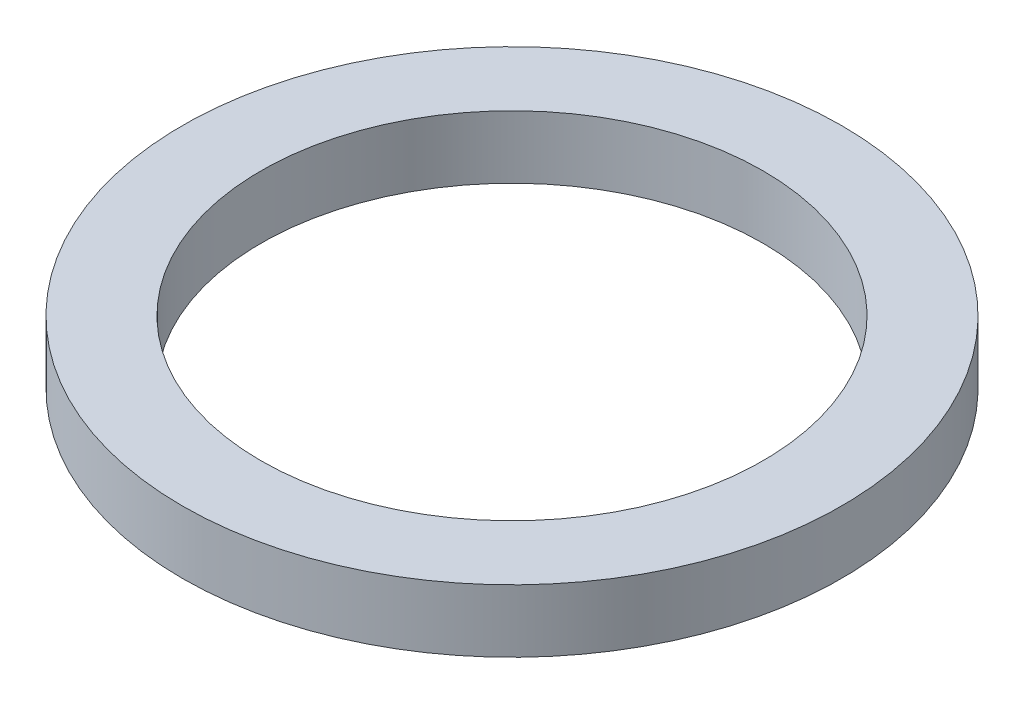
ISO-10303-21;
HEADER;
FILE_DESCRIPTION(('STEP AP214'),'2;1');
FILE_NAME('part.step','',(''),(''),'','','');
FILE_SCHEMA(('AUTOMOTIVE_DESIGN { 1 0 10303 214 1 1 1 1 }'));
ENDSEC;
DATA;
#1=APPLICATION_CONTEXT('core data for automotive mechanical design processes');
#2=APPLICATION_PROTOCOL_DEFINITION('international standard','automotive_design',2000,#1);
#3=PRODUCT_CONTEXT('',#1,'mechanical');
#4=PRODUCT('Part','Part','',(#3));
#5=PRODUCT_RELATED_PRODUCT_CATEGORY('part','',(#4));
#6=PRODUCT_DEFINITION_FORMATION('','',#4);
#7=PRODUCT_DEFINITION_CONTEXT('part definition',#1,'design');
#8=PRODUCT_DEFINITION('design','',#6,#7);
#9=PRODUCT_DEFINITION_SHAPE('','',#8);
#10=(LENGTH_UNIT() NAMED_UNIT(*) SI_UNIT(.MILLI.,.METRE.));
#11=(NAMED_UNIT(*) PLANE_ANGLE_UNIT() SI_UNIT($,.RADIAN.));
#12=(NAMED_UNIT(*) SI_UNIT($,.STERADIAN.) SOLID_ANGLE_UNIT());
#13=UNCERTAINTY_MEASURE_WITH_UNIT(LENGTH_MEASURE(1.E-05),#10,'distance_accuracy_value','');
#14=(GEOMETRIC_REPRESENTATION_CONTEXT(3) GLOBAL_UNCERTAINTY_ASSIGNED_CONTEXT((#13)) GLOBAL_UNIT_ASSIGNED_CONTEXT((#10,
#11,#12)) REPRESENTATION_CONTEXT('',''));
#15=CARTESIAN_POINT('',(0.,0.,0.));
#16=DIRECTION('',(0.,0.,1.));
#17=DIRECTION('',(1.,0.,0.));
#18=AXIS2_PLACEMENT_3D('',#15,#16,#17);
#19=CARTESIAN_POINT('',(21.8,0.,0.));
#20=DIRECTION('',(0.,1.,0.));
#21=DIRECTION('',(0.,0.,1.));
#22=AXIS2_PLACEMENT_3D('',#19,#20,#21);
#23=CYLINDRICAL_SURFACE('',#22,4.20000000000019);
#24=CARTESIAN_POINT('',(21.8,0.,0.));
#25=DIRECTION('',(0.,1.,0.));
#26=DIRECTION('',(0.,0.,-1.));
#27=AXIS2_PLACEMENT_3D('',#24,#25,#26);
#28=CIRCLE('',#27,4.20000000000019);
#29=CARTESIAN_POINT('',(21.8,0.,-4.20000000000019));
#30=VERTEX_POINT('',#29);
#31=EDGE_CURVE('E10',#30,#30,#28,.T.);
#32=ORIENTED_EDGE('',*,*,#31,.T.);
#33=EDGE_LOOP('',(#32));
#34=FACE_BOUND('',#33,.T.);
#35=CARTESIAN_POINT('',(21.8,0.8,0.));
#36=DIRECTION('',(0.,1.,0.));
#37=DIRECTION('',(0.,0.,-1.));
#38=AXIS2_PLACEMENT_3D('',#35,#36,#37);
#39=CIRCLE('',#38,4.20000000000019);
#40=CARTESIAN_POINT('',(21.8,0.8,-4.20000000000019));
#41=VERTEX_POINT('',#40);
#42=EDGE_CURVE('E354',#41,#41,#39,.T.);
#43=ORIENTED_EDGE('',*,*,#42,.F.);
#44=EDGE_LOOP('',(#43));
#45=FACE_BOUND('',#44,.T.);
#46=ADVANCED_FACE('F348',(#34,#45),#23,.T.);
#47=CARTESIAN_POINT('',(21.8,0.,0.));
#48=DIRECTION('',(0.,-1.,0.));
#49=DIRECTION('',(0.,0.,-1.));
#50=AXIS2_PLACEMENT_3D('',#47,#48,#49);
#51=PLANE('',#50);
#52=CARTESIAN_POINT('',(21.8,0.,0.));
#53=DIRECTION('',(0.,1.,0.));
#54=DIRECTION('',(0.,0.,-1.));
#55=AXIS2_PLACEMENT_3D('',#52,#53,#54);
#56=CIRCLE('',#55,3.20000000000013);
#57=CARTESIAN_POINT('',(21.8,0.,-3.20000000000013));
#58=VERTEX_POINT('',#57);
#59=EDGE_CURVE('E358',#58,#58,#56,.T.);
#60=ORIENTED_EDGE('',*,*,#59,.T.);
#61=EDGE_LOOP('',(#60));
#62=FACE_BOUND('',#61,.T.);
#63=ORIENTED_EDGE('',*,*,#31,.F.);
#64=EDGE_LOOP('',(#63));
#65=FACE_BOUND('',#64,.T.);
#66=ADVANCED_FACE('F372',(#62,#65),#51,.T.);
#67=CARTESIAN_POINT('',(21.8,0.8,0.));
#68=DIRECTION('',(0.,-1.,0.));
#69=DIRECTION('',(0.,0.,-1.));
#70=AXIS2_PLACEMENT_3D('',#67,#68,#69);
#71=PLANE('',#70);
#72=CARTESIAN_POINT('',(21.8,0.8,0.));
#73=DIRECTION('',(0.,1.,0.));
#74=DIRECTION('',(0.,0.,-1.));
#75=AXIS2_PLACEMENT_3D('',#72,#73,#74);
#76=CIRCLE('',#75,3.20000000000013);
#77=CARTESIAN_POINT('',(21.8,0.8,-3.20000000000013));
#78=VERTEX_POINT('',#77);
#79=EDGE_CURVE('E362',#78,#78,#76,.T.);
#80=ORIENTED_EDGE('',*,*,#79,.F.);
#81=EDGE_LOOP('',(#80));
#82=FACE_BOUND('',#81,.T.);
#83=ORIENTED_EDGE('',*,*,#42,.T.);
#84=EDGE_LOOP('',(#83));
#85=FACE_BOUND('',#84,.T.);
#86=ADVANCED_FACE('F370',(#82,#85),#71,.F.);
#87=CARTESIAN_POINT('',(21.8,0.,0.));
#88=DIRECTION('',(0.,1.,0.));
#89=DIRECTION('',(0.,0.,1.));
#90=AXIS2_PLACEMENT_3D('',#87,#88,#89);
#91=CYLINDRICAL_SURFACE('',#90,3.20000000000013);
#92=ORIENTED_EDGE('',*,*,#59,.F.);
#93=EDGE_LOOP('',(#92));
#94=FACE_BOUND('',#93,.T.);
#95=ORIENTED_EDGE('',*,*,#79,.T.);
#96=EDGE_LOOP('',(#95));
#97=FACE_BOUND('',#96,.T.);
#98=ADVANCED_FACE('F368',(#94,#97),#91,.F.);
#99=CLOSED_SHELL('',(#46,#66,#86,#98));
#100=MANIFOLD_SOLID_BREP('B2',#99);
#101=ADVANCED_BREP_SHAPE_REPRESENTATION('',(#18,#100),#14);
#102=SHAPE_DEFINITION_REPRESENTATION(#9,#101);
ENDSEC;
END-ISO-10303-21;
